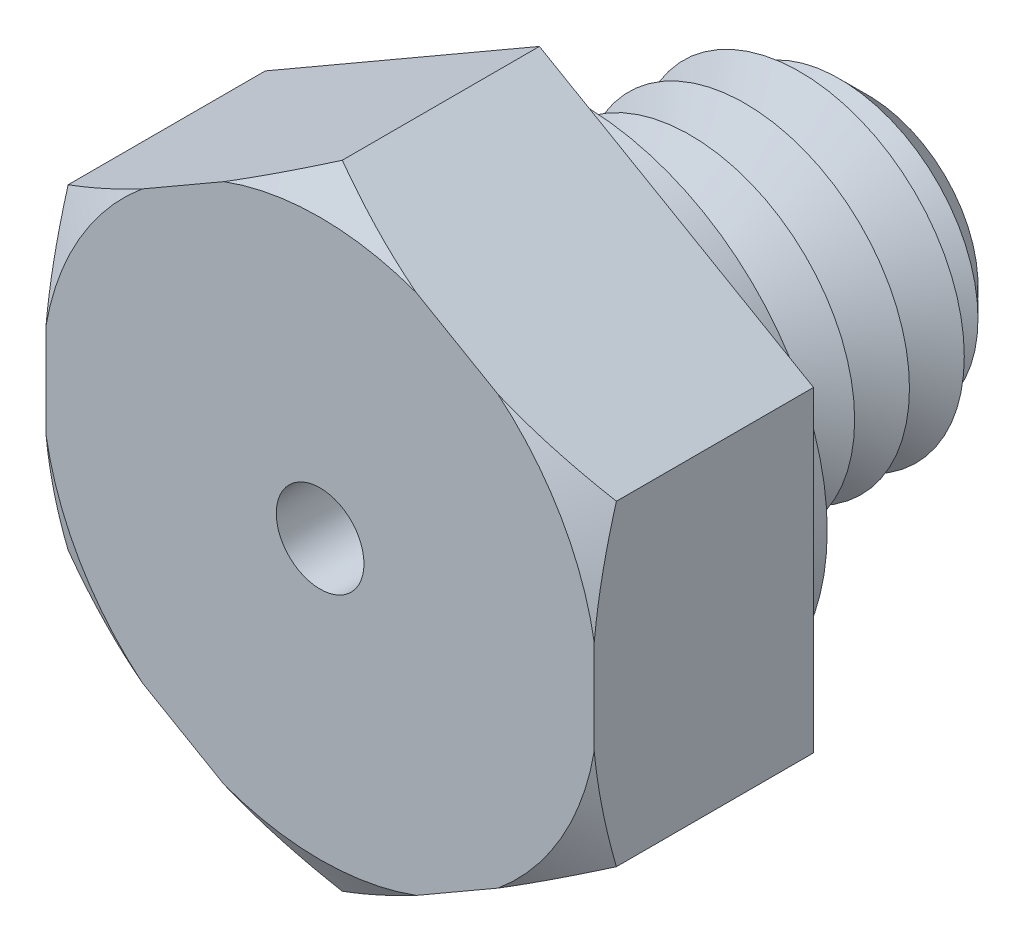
ISO-10303-21;
HEADER;
FILE_DESCRIPTION(('STEP AP214'),'2;1');
FILE_NAME('part.step','',(''),(''),'','','');
FILE_SCHEMA(('AUTOMOTIVE_DESIGN { 1 0 10303 214 1 1 1 1 }'));
ENDSEC;
DATA;
#1=APPLICATION_CONTEXT('core data for automotive mechanical design processes');
#2=APPLICATION_PROTOCOL_DEFINITION('international standard','automotive_design',2000,#1);
#3=PRODUCT_CONTEXT('',#1,'mechanical');
#4=PRODUCT('Part','Part','',(#3));
#5=PRODUCT_RELATED_PRODUCT_CATEGORY('part','',(#4));
#6=PRODUCT_DEFINITION_FORMATION('','',#4);
#7=PRODUCT_DEFINITION_CONTEXT('part definition',#1,'design');
#8=PRODUCT_DEFINITION('design','',#6,#7);
#9=PRODUCT_DEFINITION_SHAPE('','',#8);
#10=(LENGTH_UNIT() NAMED_UNIT(*) SI_UNIT(.MILLI.,.METRE.));
#11=(NAMED_UNIT(*) PLANE_ANGLE_UNIT() SI_UNIT($,.RADIAN.));
#12=(NAMED_UNIT(*) SI_UNIT($,.STERADIAN.) SOLID_ANGLE_UNIT());
#13=UNCERTAINTY_MEASURE_WITH_UNIT(LENGTH_MEASURE(1.E-05),#10,'distance_accuracy_value','');
#14=(GEOMETRIC_REPRESENTATION_CONTEXT(3) GLOBAL_UNCERTAINTY_ASSIGNED_CONTEXT((#13)) GLOBAL_UNIT_ASSIGNED_CONTEXT((#10,
#11,#12)) REPRESENTATION_CONTEXT('',''));
#15=CARTESIAN_POINT('',(0.,0.,0.));
#16=DIRECTION('',(0.,0.,1.));
#17=DIRECTION('',(1.,0.,0.));
#18=AXIS2_PLACEMENT_3D('',#15,#16,#17);
#19=CARTESIAN_POINT('',(5.,2.88675134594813,4.));
#20=DIRECTION('',(-0.5,-0.866025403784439,0.));
#21=DIRECTION('',(0.866025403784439,-0.5,0.));
#22=AXIS2_PLACEMENT_3D('',#19,#20,#21);
#23=PLANE('',#22);
#24=CARTESIAN_POINT('',(8.47277829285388,0.881741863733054,2.01100959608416));
#25=CARTESIAN_POINT('',(8.31567675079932,0.972444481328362,2.09578624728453));
#26=CARTESIAN_POINT('',(8.15819937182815,1.06336408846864,2.17964850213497));
#27=CARTESIAN_POINT('',(7.84233445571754,1.24572878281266,2.34511482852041));
#28=CARTESIAN_POINT('',(7.68394680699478,1.33717393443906,2.42671861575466));
#29=CARTESIAN_POINT('',(7.36563241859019,1.52095283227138,2.58747458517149));
#30=CARTESIAN_POINT('',(7.2057023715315,1.61328848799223,2.66661806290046));
#31=CARTESIAN_POINT('',(6.88464436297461,1.79865141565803,2.82158887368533));
#32=CARTESIAN_POINT('',(6.72351643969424,1.89167866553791,2.89741631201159));
#33=CARTESIAN_POINT('',(6.39574451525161,2.08091787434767,3.04691088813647));
#34=CARTESIAN_POINT('',(6.22906463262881,2.17715054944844,3.12047362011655));
#35=CARTESIAN_POINT('',(5.89404164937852,2.37057615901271,3.26235309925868));
#36=CARTESIAN_POINT('',(5.72569864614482,2.46776903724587,3.33067015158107));
#37=CARTESIAN_POINT('',(5.38728347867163,2.66315312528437,3.46077059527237));
#38=CARTESIAN_POINT('',(5.21721304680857,2.7613433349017,3.52255993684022));
#39=CARTESIAN_POINT('',(4.87507545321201,2.95887656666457,3.63817490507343));
#40=CARTESIAN_POINT('',(4.70300855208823,3.05821943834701,3.69200155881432));
#41=CARTESIAN_POINT('',(4.29152467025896,3.29578976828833,3.8084273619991));
#42=CARTESIAN_POINT('',(4.05114917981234,3.43457062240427,3.86669526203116));
#43=CARTESIAN_POINT('',(3.68812002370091,3.64416560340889,3.93673911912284));
#44=CARTESIAN_POINT('',(3.56670137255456,3.71426669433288,3.95719387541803));
#45=CARTESIAN_POINT('',(3.32319777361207,3.85485356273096,3.99180309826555));
#46=CARTESIAN_POINT('',(3.20111291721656,3.92533928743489,4.0059584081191));
#47=CARTESIAN_POINT('',(2.95790980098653,4.06575267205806,4.0274398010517));
#48=CARTESIAN_POINT('',(2.83679666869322,4.13567737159,4.03484289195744));
#49=CARTESIAN_POINT('',(2.59440145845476,4.27562431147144,4.04287861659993));
#50=CARTESIAN_POINT('',(2.47311938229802,4.34564655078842,4.04351132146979));
#51=CARTESIAN_POINT('',(2.23067249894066,4.48562332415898,4.03798617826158));
#52=CARTESIAN_POINT('',(2.10950769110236,4.55557785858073,4.03182836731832));
#53=CARTESIAN_POINT('',(1.86755304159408,4.69527044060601,4.01290860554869));
#54=CARTESIAN_POINT('',(1.74676325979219,4.76500845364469,4.00014564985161));
#55=CARTESIAN_POINT('',(1.46148107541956,4.92971619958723,3.96252552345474));
#56=CARTESIAN_POINT('',(1.29725580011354,5.0245317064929,3.93494657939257));
#57=CARTESIAN_POINT('',(0.970375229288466,5.21325629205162,3.86938275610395));
#58=CARTESIAN_POINT('',(0.807720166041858,5.3071652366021,3.83139636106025));
#59=CARTESIAN_POINT('',(0.484000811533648,5.49406469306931,3.7464515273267));
#60=CARTESIAN_POINT('',(0.322938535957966,5.58705404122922,3.6994829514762));
#61=CARTESIAN_POINT('',(0.0026211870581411,5.77198934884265,3.59805355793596));
#62=CARTESIAN_POINT('',(-0.156634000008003,5.86393537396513,3.54359321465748));
#63=CARTESIAN_POINT('',(-0.475335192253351,6.04793759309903,3.42778810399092));
#64=CARTESIAN_POINT('',(-0.634760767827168,6.13998199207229,3.3663688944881));
#65=CARTESIAN_POINT('',(-0.951922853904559,6.32309560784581,3.23836766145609));
#66=CARTESIAN_POINT('',(-1.10966040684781,6.41416542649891,3.17178906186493));
#67=CARTESIAN_POINT('',(-1.42369760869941,6.59547488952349,3.0343839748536));
#68=CARTESIAN_POINT('',(-1.57999755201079,6.68571470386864,2.96355838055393));
#69=CARTESIAN_POINT('',(-1.89137153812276,6.86548655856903,2.81840247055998));
#70=CARTESIAN_POINT('',(-2.0464455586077,6.95501858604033,2.74407209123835));
#71=CARTESIAN_POINT('',(-2.30843737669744,7.10627963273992,2.61560341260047));
#72=CARTESIAN_POINT('',(-2.41563149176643,7.16816818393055,2.56221329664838));
#73=CARTESIAN_POINT('',(-2.62954890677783,7.29167346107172,2.45420118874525));
#74=CARTESIAN_POINT('',(-2.7362722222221,7.35329019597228,2.39957923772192));
#75=CARTESIAN_POINT('',(-2.94817046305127,7.47562970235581,2.28983212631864));
#76=CARTESIAN_POINT('',(-3.05334983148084,7.53635503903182,2.23471838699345));
#77=CARTESIAN_POINT('',(-3.26333506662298,7.65759007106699,2.12354428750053));
#78=CARTESIAN_POINT('',(-3.36814092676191,7.71809976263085,2.06748391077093));
#79=CARTESIAN_POINT('',(-3.47277829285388,7.77851217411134,2.01100959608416));
#80=B_SPLINE_CURVE_WITH_KNOTS('',3,(#24,#25,#26,#27,#28,#29,#30,#31,#32,#33,#34,#35,#36,#37,#38,
#39,#40,#41,#42,#43,#44,#45,#46,#47,#48,#49,#50,#51,#52,#53,#54,#55,#56,#57,#58,#59,#60,#61,#62,
#63,#64,#65,#66,#67,#68,#69,#70,#71,#72,#73,#74,#75,#76,#77,#78,#79),.UNSPECIFIED.,.F.,.F.,(4,2,
2,2,2,2,2,2,2,2,2,2,2,2,2,2,2,2,2,2,2,2,2,2,2,2,2,4),(0.,0.600718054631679,1.20151138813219,
1.80423204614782,2.40693355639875,3.02500509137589,3.64304064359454,4.26050788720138,
4.87789541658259,5.72780796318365,6.1527500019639,6.57763513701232,6.99761163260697,
7.41758371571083,7.83755350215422,8.25758719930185,8.83211758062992,9.40673168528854,
9.98199815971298,10.5572282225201,11.1393271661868,11.7210430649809,12.3026370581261,
12.8842416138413,13.2886376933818,13.6930203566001,14.0931288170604,14.493244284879),.UNSPECIFIED.);
#81=CARTESIAN_POINT('',(5.,2.88675134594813,3.59585481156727));
#82=VERTEX_POINT('',#81);
#83=CARTESIAN_POINT('',(3.24519941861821,3.89988593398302,4.));
#84=VERTEX_POINT('',#83);
#85=EDGE_CURVE('E132',#82,#84,#80,.T.);
#86=ORIENTED_EDGE('',*,*,#85,.F.);
#87=DIRECTION('',(0.,0.,-1.));
#88=VECTOR('',#87,1.);
#89=CARTESIAN_POINT('',(5.,2.88675134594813,4.));
#90=LINE('',#89,#88);
#91=CARTESIAN_POINT('',(5.,2.88675134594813,0.));
#92=VERTEX_POINT('',#91);
#93=EDGE_CURVE('E144',#82,#92,#90,.T.);
#94=ORIENTED_EDGE('',*,*,#93,.T.);
#95=DIRECTION('',(-0.866025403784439,0.5,0.));
#96=VECTOR('',#95,1.);
#97=CARTESIAN_POINT('',(5.,2.88675134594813,0.));
#98=LINE('',#97,#96);
#99=CARTESIAN_POINT('',(0.,5.77350269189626,0.));
#100=VERTEX_POINT('',#99);
#101=EDGE_CURVE('E245',#92,#100,#98,.T.);
#102=ORIENTED_EDGE('',*,*,#101,.T.);
#103=DIRECTION('',(0.,0.,-1.));
#104=VECTOR('',#103,1.);
#105=CARTESIAN_POINT('',(0.,5.77350269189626,4.));
#106=LINE('',#105,#104);
#107=CARTESIAN_POINT('',(0.,5.77350269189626,3.59585481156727));
#108=VERTEX_POINT('',#107);
#109=EDGE_CURVE('E179',#108,#100,#106,.T.);
#110=ORIENTED_EDGE('',*,*,#109,.F.);
#111=CARTESIAN_POINT('',(1.75480058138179,4.76036810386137,4.));
#112=VERTEX_POINT('',#111);
#113=EDGE_CURVE('E151',#112,#108,#80,.T.);
#114=ORIENTED_EDGE('',*,*,#113,.F.);
#115=DIRECTION('',(-0.866025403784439,0.5,0.));
#116=VECTOR('',#115,1.);
#117=CARTESIAN_POINT('',(5.,2.88675134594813,4.));
#118=LINE('',#117,#116);
#119=EDGE_CURVE('E148',#84,#112,#118,.T.);
#120=ORIENTED_EDGE('',*,*,#119,.F.);
#121=EDGE_LOOP('',(#86,#94,#102,#110,#114,#120));
#122=FACE_BOUND('',#121,.T.);
#123=ADVANCED_FACE('F39',(#122),#23,.F.);
#124=CARTESIAN_POINT('',(0.,5.77350269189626,4.));
#125=DIRECTION('',(0.5,-0.866025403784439,0.));
#126=DIRECTION('',(0.866025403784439,0.5,0.));
#127=AXIS2_PLACEMENT_3D('',#124,#125,#126);
#128=PLANE('',#127);
#129=CARTESIAN_POINT('',(3.47277829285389,7.77851217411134,2.01100959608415));
#130=CARTESIAN_POINT('',(3.31567675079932,7.68780955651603,2.09578624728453));
#131=CARTESIAN_POINT('',(3.15819937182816,7.59688994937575,2.17964850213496));
#132=CARTESIAN_POINT('',(2.84233445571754,7.41452525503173,2.34511482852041));
#133=CARTESIAN_POINT('',(2.68394680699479,7.32308010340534,2.42671861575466));
#134=CARTESIAN_POINT('',(2.3656324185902,7.13930120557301,2.58747458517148));
#135=CARTESIAN_POINT('',(2.2057023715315,7.04696554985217,2.66661806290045));
#136=CARTESIAN_POINT('',(1.88464436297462,6.86160262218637,2.82158887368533));
#137=CARTESIAN_POINT('',(1.72351643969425,6.76857537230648,2.89741631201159));
#138=CARTESIAN_POINT('',(1.39574451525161,6.57933616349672,3.04691088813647));
#139=CARTESIAN_POINT('',(1.22906463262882,6.48310348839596,3.12047362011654));
#140=CARTESIAN_POINT('',(0.89404164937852,6.28967787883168,3.26235309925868));
#141=CARTESIAN_POINT('',(0.725698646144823,6.19248500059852,3.33067015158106));
#142=CARTESIAN_POINT('',(0.387283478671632,5.99710091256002,3.46077059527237));
#143=CARTESIAN_POINT('',(0.217213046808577,5.89891070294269,3.52255993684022));
#144=CARTESIAN_POINT('',(-0.124924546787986,5.70137747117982,3.63817490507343));
#145=CARTESIAN_POINT('',(-0.296991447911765,5.60203459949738,3.69200155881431));
#146=CARTESIAN_POINT('',(-0.708475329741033,5.36446426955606,3.8084273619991));
#147=CARTESIAN_POINT('',(-0.948850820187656,5.22568341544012,3.86669526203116));
#148=CARTESIAN_POINT('',(-1.31187997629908,5.0160884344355,3.93673911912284));
#149=CARTESIAN_POINT('',(-1.43329862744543,4.94598734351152,3.95719387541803));
#150=CARTESIAN_POINT('',(-1.67680222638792,4.80540047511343,3.99180309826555));
#151=CARTESIAN_POINT('',(-1.79888708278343,4.7349147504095,4.0059584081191));
#152=CARTESIAN_POINT('',(-2.04209019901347,4.59450136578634,4.0274398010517));
#153=CARTESIAN_POINT('',(-2.16320333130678,4.52457666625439,4.03484289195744));
#154=CARTESIAN_POINT('',(-2.40559854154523,4.38462972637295,4.04287861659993));
#155=CARTESIAN_POINT('',(-2.52688061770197,4.31460748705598,4.04351132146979));
#156=CARTESIAN_POINT('',(-2.76932750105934,4.17463071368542,4.03798617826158));
#157=CARTESIAN_POINT('',(-2.89049230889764,4.10467617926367,4.03182836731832));
#158=CARTESIAN_POINT('',(-3.13244695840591,3.96498359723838,4.01290860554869));
#159=CARTESIAN_POINT('',(-3.25323674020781,3.8952455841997,4.00014564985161));
#160=CARTESIAN_POINT('',(-3.53851892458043,3.73053783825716,3.96252552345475));
#161=CARTESIAN_POINT('',(-3.70274419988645,3.63572233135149,3.93494657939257));
#162=CARTESIAN_POINT('',(-4.02962477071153,3.44699774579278,3.86938275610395));
#163=CARTESIAN_POINT('',(-4.19227983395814,3.35308880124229,3.83139636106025));
#164=CARTESIAN_POINT('',(-4.51599918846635,3.16618934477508,3.7464515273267));
#165=CARTESIAN_POINT('',(-4.67706146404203,3.07319999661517,3.6994829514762));
#166=CARTESIAN_POINT('',(-4.99737881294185,2.88826468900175,3.59805355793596));
#167=CARTESIAN_POINT('',(-5.156634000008,2.79631866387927,3.54359321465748));
#168=CARTESIAN_POINT('',(-5.47533519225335,2.61231644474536,3.42778810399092));
#169=CARTESIAN_POINT('',(-5.63476076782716,2.5202720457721,3.3663688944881));
#170=CARTESIAN_POINT('',(-5.95192285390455,2.33715842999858,3.23836766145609));
#171=CARTESIAN_POINT('',(-6.10966040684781,2.24608861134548,3.17178906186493));
#172=CARTESIAN_POINT('',(-6.4236976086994,2.06477914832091,3.03438397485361));
#173=CARTESIAN_POINT('',(-6.57999755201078,1.97453933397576,2.96355838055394));
#174=CARTESIAN_POINT('',(-6.89137153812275,1.79476747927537,2.81840247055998));
#175=CARTESIAN_POINT('',(-7.04644555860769,1.70523545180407,2.74407209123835));
#176=CARTESIAN_POINT('',(-7.30843737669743,1.55397440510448,2.61560341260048));
#177=CARTESIAN_POINT('',(-7.41563149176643,1.49208585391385,2.56221329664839));
#178=CARTESIAN_POINT('',(-7.62954890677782,1.36858057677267,2.45420118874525));
#179=CARTESIAN_POINT('',(-7.7362722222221,1.30696384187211,2.39957923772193));
#180=CARTESIAN_POINT('',(-7.94817046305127,1.18462433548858,2.28983212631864));
#181=CARTESIAN_POINT('',(-8.05334983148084,1.12389899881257,2.23471838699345));
#182=CARTESIAN_POINT('',(-8.26333506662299,1.0026639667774,2.12354428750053));
#183=CARTESIAN_POINT('',(-8.36814092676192,0.942154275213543,2.06748391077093));
#184=CARTESIAN_POINT('',(-8.47277829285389,0.88174186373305,2.01100959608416));
#185=B_SPLINE_CURVE_WITH_KNOTS('',3,(#129,#130,#131,#132,#133,#134,#135,#136,#137,#138,#139,
#140,#141,#142,#143,#144,#145,#146,#147,#148,#149,#150,#151,#152,#153,#154,#155,#156,#157,#158,
#159,#160,#161,#162,#163,#164,#165,#166,#167,#168,#169,#170,#171,#172,#173,#174,#175,#176,#177,
#178,#179,#180,#181,#182,#183,#184),.UNSPECIFIED.,.F.,.F.,(4,2,2,2,2,2,2,2,2,2,2,2,2,2,2,2,2,2,
2,2,2,2,2,2,2,2,2,4),(0.,0.600718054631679,1.20151138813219,1.80423204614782,2.40693355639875,
3.02500509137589,3.64304064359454,4.26050788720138,4.87789541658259,5.72780796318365,
6.1527500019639,6.57763513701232,6.99761163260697,7.41758371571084,7.83755350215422,
8.25758719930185,8.83211758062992,9.40673168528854,9.98199815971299,10.5572282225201,
11.1393271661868,11.7210430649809,12.3026370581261,12.8842416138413,13.2886376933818,
13.6930203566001,14.0931288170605,14.493244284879),.UNSPECIFIED.);
#186=CARTESIAN_POINT('',(-1.75480058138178,4.76036810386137,4.));
#187=VERTEX_POINT('',#186);
#188=EDGE_CURVE('E296',#108,#187,#185,.T.);
#189=ORIENTED_EDGE('',*,*,#188,.F.);
#190=ORIENTED_EDGE('',*,*,#109,.T.);
#191=DIRECTION('',(-0.866025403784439,-0.5,0.));
#192=VECTOR('',#191,1.);
#193=CARTESIAN_POINT('',(0.,5.77350269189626,0.));
#194=LINE('',#193,#192);
#195=CARTESIAN_POINT('',(-5.,2.88675134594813,0.));
#196=VERTEX_POINT('',#195);
#197=EDGE_CURVE('E264',#100,#196,#194,.T.);
#198=ORIENTED_EDGE('',*,*,#197,.T.);
#199=DIRECTION('',(0.,0.,-1.));
#200=VECTOR('',#199,1.);
#201=CARTESIAN_POINT('',(-5.,2.88675134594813,4.));
#202=LINE('',#201,#200);
#203=CARTESIAN_POINT('',(-5.,2.88675134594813,3.59585481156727));
#204=VERTEX_POINT('',#203);
#205=EDGE_CURVE('E176',#204,#196,#202,.T.);
#206=ORIENTED_EDGE('',*,*,#205,.F.);
#207=CARTESIAN_POINT('',(-3.24519941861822,3.89988593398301,4.));
#208=VERTEX_POINT('',#207);
#209=EDGE_CURVE('E300',#208,#204,#185,.T.);
#210=ORIENTED_EDGE('',*,*,#209,.F.);
#211=DIRECTION('',(-0.866025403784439,-0.5,0.));
#212=VECTOR('',#211,1.);
#213=CARTESIAN_POINT('',(0.,5.77350269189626,4.));
#214=LINE('',#213,#212);
#215=EDGE_CURVE('E247',#187,#208,#214,.T.);
#216=ORIENTED_EDGE('',*,*,#215,.F.);
#217=EDGE_LOOP('',(#189,#190,#198,#206,#210,#216));
#218=FACE_BOUND('',#217,.T.);
#219=ADVANCED_FACE('F293',(#218),#128,.F.);
#220=CARTESIAN_POINT('',(-5.,2.88675134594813,4.));
#221=DIRECTION('',(1.,0.,0.));
#222=DIRECTION('',(0.,0.,-1.));
#223=AXIS2_PLACEMENT_3D('',#220,#221,#222);
#224=PLANE('',#223);
#225=CARTESIAN_POINT('',(-5.,6.35952963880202,2.25858442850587));
#226=CARTESIAN_POINT('',(-5.,6.17888675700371,2.34055079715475));
#227=CARTESIAN_POINT('',(-5.,5.99774985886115,2.42144915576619));
#228=CARTESIAN_POINT('',(-5.,5.63427640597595,2.58059164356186));
#229=CARTESIAN_POINT('',(-5.,5.45193964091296,2.65883529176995));
#230=CARTESIAN_POINT('',(-5.,5.08515575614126,2.81244019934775));
#231=CARTESIAN_POINT('',(-5.,4.90070300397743,2.8877880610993));
#232=CARTESIAN_POINT('',(-5.,4.53023851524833,3.0345384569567));
#233=CARTESIAN_POINT('',(-5.,4.34422685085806,3.10594117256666));
#234=CARTESIAN_POINT('',(-5.,3.97124978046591,3.24361472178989));
#235=CARTESIAN_POINT('',(-5.,3.78429235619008,3.30990707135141));
#236=CARTESIAN_POINT('',(-5.,3.40837814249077,3.43663614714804));
#237=CARTESIAN_POINT('',(-5.,3.21942124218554,3.49707254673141));
#238=CARTESIAN_POINT('',(-5.,2.83960832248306,3.61070280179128));
#239=CARTESIAN_POINT('',(-5.,2.64875526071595,3.66390646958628));
#240=CARTESIAN_POINT('',(-5.,2.26482213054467,3.76165698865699));
#241=CARTESIAN_POINT('',(-5.,2.07174215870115,3.80620421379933));
#242=CARTESIAN_POINT('',(-5.,1.7384332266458,3.87385543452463));
#243=CARTESIAN_POINT('',(-5.,1.59871159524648,3.89946008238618));
#244=CARTESIAN_POINT('',(-5.,1.31833206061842,3.94478995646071));
#245=CARTESIAN_POINT('',(-5.,1.17767431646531,3.96451615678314));
#246=CARTESIAN_POINT('',(-5.,0.89562976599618,3.99757345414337));
#247=CARTESIAN_POINT('',(-5.,0.754243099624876,4.01090573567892));
#248=CARTESIAN_POINT('',(-5.,0.470989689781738,4.03079351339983));
#249=CARTESIAN_POINT('',(-5.,0.329122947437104,4.03734902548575));
#250=CARTESIAN_POINT('',(-5.,0.0453101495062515,4.04347876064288));
#251=CARTESIAN_POINT('',(-5.,-0.0966358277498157,4.04305657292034));
#252=CARTESIAN_POINT('',(-5.,-0.380333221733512,4.03525341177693));
#253=CARTESIAN_POINT('',(-5.,-0.522084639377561,4.02787247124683));
#254=CARTESIAN_POINT('',(-5.,-0.805078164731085,4.00637695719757));
#255=CARTESIAN_POINT('',(-5.,-0.946320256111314,3.99226216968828));
#256=CARTESIAN_POINT('',(-5.,-1.22803871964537,3.95770663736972));
#257=CARTESIAN_POINT('',(-5.,-1.36851494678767,3.93726473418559));
#258=CARTESIAN_POINT('',(-5.,-1.92842653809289,3.84388033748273));
#259=CARTESIAN_POINT('',(-5.,-2.34409397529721,3.74768165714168));
#260=CARTESIAN_POINT('',(-5.,-2.95991397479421,3.57615402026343));
#261=CARTESIAN_POINT('',(-5.,-3.16417440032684,3.51433916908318));
#262=CARTESIAN_POINT('',(-5.,-3.57033913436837,3.3833457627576));
#263=CARTESIAN_POINT('',(-5.,-3.77224360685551,3.31416772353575));
#264=CARTESIAN_POINT('',(-5.,-4.17620397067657,3.16907432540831));
#265=CARTESIAN_POINT('',(-5.,-4.37823505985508,3.09309081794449));
#266=CARTESIAN_POINT('',(-5.,-4.7804110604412,2.9362625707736));
#267=CARTESIAN_POINT('',(-5.,-4.98055585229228,2.85541752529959));
#268=CARTESIAN_POINT('',(-5.,-5.37797431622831,2.69033488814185));
#269=CARTESIAN_POINT('',(-5.,-5.57525810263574,2.60612151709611));
#270=CARTESIAN_POINT('',(-5.,-5.96839598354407,2.43454627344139));
#271=CARTESIAN_POINT('',(-5.,-6.16425041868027,2.34718518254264));
#272=CARTESIAN_POINT('',(-5.,-6.35952963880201,2.25858442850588));
#273=B_SPLINE_CURVE_WITH_KNOTS('',3,(#225,#226,#227,#228,#229,#230,#231,#232,#233,#234,#235,
#236,#237,#238,#239,#240,#241,#242,#243,#244,#245,#246,#247,#248,#249,#250,#251,#252,#253,#254,
#255,#256,#257,#258,#259,#260,#261,#262,#263,#264,#265,#266,#267,#268,#269,#270,#271,#272),
.UNSPECIFIED.,.F.,.F.,(4,2,2,2,2,2,2,2,2,2,2,2,2,2,2,2,2,2,2,2,2,2,2,4),(0.,0.595116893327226,
1.19034103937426,1.78805021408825,2.3857318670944,2.98074146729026,3.57578423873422,
4.17001151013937,4.76421311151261,5.19024951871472,5.61621528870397,6.0421021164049,
6.46798794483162,6.89365471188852,7.3193194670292,7.74499774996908,8.17075401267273,
9.44769357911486,10.0878733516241,10.7280082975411,11.3754821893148,12.0229968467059,
12.6664852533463,13.3098149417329),.UNSPECIFIED.);
#274=CARTESIAN_POINT('',(-5.,0.860482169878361,4.));
#275=VERTEX_POINT('',#274);
#276=EDGE_CURVE('E304',#204,#275,#273,.T.);
#277=ORIENTED_EDGE('',*,*,#276,.F.);
#278=ORIENTED_EDGE('',*,*,#205,.T.);
#279=DIRECTION('',(0.,-1.,0.));
#280=VECTOR('',#279,1.);
#281=CARTESIAN_POINT('',(-5.,2.88675134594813,0.));
#282=LINE('',#281,#280);
#283=CARTESIAN_POINT('',(-5.,-2.88675134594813,0.));
#284=VERTEX_POINT('',#283);
#285=EDGE_CURVE('E267',#196,#284,#282,.T.);
#286=ORIENTED_EDGE('',*,*,#285,.T.);
#287=DIRECTION('',(0.,0.,-1.));
#288=VECTOR('',#287,1.);
#289=CARTESIAN_POINT('',(-5.,-2.88675134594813,4.));
#290=LINE('',#289,#288);
#291=CARTESIAN_POINT('',(-5.,-2.88675134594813,3.59585481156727));
#292=VERTEX_POINT('',#291);
#293=EDGE_CURVE('E173',#292,#284,#290,.T.);
#294=ORIENTED_EDGE('',*,*,#293,.F.);
#295=CARTESIAN_POINT('',(-5.,-0.860482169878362,4.));
#296=VERTEX_POINT('',#295);
#297=EDGE_CURVE('E311',#296,#292,#273,.T.);
#298=ORIENTED_EDGE('',*,*,#297,.F.);
#299=DIRECTION('',(0.,-1.,0.));
#300=VECTOR('',#299,1.);
#301=CARTESIAN_POINT('',(-5.,2.88675134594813,4.));
#302=LINE('',#301,#300);
#303=EDGE_CURVE('E251',#275,#296,#302,.T.);
#304=ORIENTED_EDGE('',*,*,#303,.F.);
#305=EDGE_LOOP('',(#277,#278,#286,#294,#298,#304));
#306=FACE_BOUND('',#305,.T.);
#307=ADVANCED_FACE('F356',(#306),#224,.F.);
#308=CARTESIAN_POINT('',(-5.,-2.88675134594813,4.));
#309=DIRECTION('',(0.5,0.866025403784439,0.));
#310=DIRECTION('',(-0.866025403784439,0.5,0.));
#311=AXIS2_PLACEMENT_3D('',#308,#309,#310);
#312=PLANE('',#311);
#313=CARTESIAN_POINT('',(-8.47277829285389,-0.881741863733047,2.01100959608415));
#314=CARTESIAN_POINT('',(-8.31567675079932,-0.972444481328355,2.09578624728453));
#315=CARTESIAN_POINT('',(-8.15819937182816,-1.06336408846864,2.17964850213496));
#316=CARTESIAN_POINT('',(-7.84233445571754,-1.24572878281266,2.34511482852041));
#317=CARTESIAN_POINT('',(-7.68394680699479,-1.33717393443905,2.42671861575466));
#318=CARTESIAN_POINT('',(-7.3656324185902,-1.52095283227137,2.58747458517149));
#319=CARTESIAN_POINT('',(-7.2057023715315,-1.61328848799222,2.66661806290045));
#320=CARTESIAN_POINT('',(-6.88464436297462,-1.79865141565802,2.82158887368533));
#321=CARTESIAN_POINT('',(-6.72351643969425,-1.89167866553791,2.89741631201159));
#322=CARTESIAN_POINT('',(-6.39574451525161,-2.08091787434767,3.04691088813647));
#323=CARTESIAN_POINT('',(-6.22906463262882,-2.17715054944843,3.12047362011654));
#324=CARTESIAN_POINT('',(-5.89404164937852,-2.3705761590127,3.26235309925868));
#325=CARTESIAN_POINT('',(-5.72569864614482,-2.46776903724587,3.33067015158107));
#326=CARTESIAN_POINT('',(-5.38728347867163,-2.66315312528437,3.46077059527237));
#327=CARTESIAN_POINT('',(-5.21721304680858,-2.7613433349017,3.52255993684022));
#328=CARTESIAN_POINT('',(-4.87507545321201,-2.95887656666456,3.63817490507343));
#329=CARTESIAN_POINT('',(-4.70300855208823,-3.058219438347,3.69200155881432));
#330=CARTESIAN_POINT('',(-4.29152467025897,-3.29578976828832,3.8084273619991));
#331=CARTESIAN_POINT('',(-4.05114917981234,-3.43457062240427,3.86669526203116));
#332=CARTESIAN_POINT('',(-3.68812002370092,-3.64416560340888,3.93673911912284));
#333=CARTESIAN_POINT('',(-3.56670137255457,-3.71426669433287,3.95719387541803));
#334=CARTESIAN_POINT('',(-3.32319777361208,-3.85485356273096,3.99180309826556));
#335=CARTESIAN_POINT('',(-3.20111291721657,-3.92533928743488,4.0059584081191));
#336=CARTESIAN_POINT('',(-2.95790980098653,-4.06575267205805,4.0274398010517));
#337=CARTESIAN_POINT('',(-2.83679666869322,-4.13567737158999,4.03484289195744));
#338=CARTESIAN_POINT('',(-2.59440145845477,-4.27562431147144,4.04287861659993));
#339=CARTESIAN_POINT('',(-2.47311938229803,-4.34564655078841,4.0435113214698));
#340=CARTESIAN_POINT('',(-2.23067249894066,-4.48562332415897,4.03798617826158));
#341=CARTESIAN_POINT('',(-2.10950769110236,-4.55557785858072,4.03182836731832));
#342=CARTESIAN_POINT('',(-1.86755304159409,-4.69527044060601,4.01290860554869));
#343=CARTESIAN_POINT('',(-1.74676325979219,-4.76500845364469,4.00014564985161));
#344=CARTESIAN_POINT('',(-1.46148107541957,-4.92971619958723,3.96252552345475));
#345=CARTESIAN_POINT('',(-1.29725580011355,-5.0245317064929,3.93494657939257));
#346=CARTESIAN_POINT('',(-0.970375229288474,-5.21325629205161,3.86938275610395));
#347=CARTESIAN_POINT('',(-0.807720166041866,-5.3071652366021,3.83139636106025));
#348=CARTESIAN_POINT('',(-0.484000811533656,-5.4940646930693,3.7464515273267));
#349=CARTESIAN_POINT('',(-0.322938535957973,-5.58705404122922,3.6994829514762));
#350=CARTESIAN_POINT('',(-0.00262118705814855,-5.77198934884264,3.59805355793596));
#351=CARTESIAN_POINT('',(0.156634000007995,-5.86393537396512,3.54359321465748));
#352=CARTESIAN_POINT('',(0.475335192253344,-6.04793759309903,3.42778810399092));
#353=CARTESIAN_POINT('',(0.634760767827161,-6.13998199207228,3.3663688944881));
#354=CARTESIAN_POINT('',(0.951922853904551,-6.32309560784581,3.23836766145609));
#355=CARTESIAN_POINT('',(1.1096604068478,-6.41416542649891,3.17178906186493));
#356=CARTESIAN_POINT('',(1.4236976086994,-6.59547488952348,3.03438397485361));
#357=CARTESIAN_POINT('',(1.57999755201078,-6.68571470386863,2.96355838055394));
#358=CARTESIAN_POINT('',(1.89137153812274,-6.86548655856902,2.81840247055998));
#359=CARTESIAN_POINT('',(2.04644555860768,-6.95501858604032,2.74407209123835));
#360=CARTESIAN_POINT('',(2.30843737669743,-7.10627963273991,2.61560341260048));
#361=CARTESIAN_POINT('',(2.41563149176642,-7.16816818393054,2.56221329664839));
#362=CARTESIAN_POINT('',(2.62954890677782,-7.29167346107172,2.45420118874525));
#363=CARTESIAN_POINT('',(2.73627222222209,-7.35329019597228,2.39957923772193));
#364=CARTESIAN_POINT('',(2.94817046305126,-7.47562970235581,2.28983212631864));
#365=CARTESIAN_POINT('',(3.05334983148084,-7.53635503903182,2.23471838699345));
#366=CARTESIAN_POINT('',(3.26333506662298,-7.65759007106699,2.12354428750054));
#367=CARTESIAN_POINT('',(3.36814092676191,-7.71809976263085,2.06748391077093));
#368=CARTESIAN_POINT('',(3.47277829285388,-7.77851217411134,2.01100959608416));
#369=B_SPLINE_CURVE_WITH_KNOTS('',3,(#313,#314,#315,#316,#317,#318,#319,#320,#321,#322,#323,
#324,#325,#326,#327,#328,#329,#330,#331,#332,#333,#334,#335,#336,#337,#338,#339,#340,#341,#342,
#343,#344,#345,#346,#347,#348,#349,#350,#351,#352,#353,#354,#355,#356,#357,#358,#359,#360,#361,
#362,#363,#364,#365,#366,#367,#368),.UNSPECIFIED.,.F.,.F.,(4,2,2,2,2,2,2,2,2,2,2,2,2,2,2,2,2,2,
2,2,2,2,2,2,2,2,2,4),(0.,0.600718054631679,1.20151138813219,1.80423204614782,2.40693355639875,
3.02500509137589,3.64304064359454,4.26050788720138,4.87789541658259,5.72780796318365,
6.1527500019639,6.57763513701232,6.99761163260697,7.41758371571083,7.83755350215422,
8.25758719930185,8.83211758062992,9.40673168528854,9.98199815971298,10.5572282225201,
11.1393271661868,11.7210430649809,12.3026370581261,12.8842416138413,13.2886376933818,
13.6930203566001,14.0931288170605,14.493244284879),.UNSPECIFIED.);
#370=CARTESIAN_POINT('',(-3.24519941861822,-3.89988593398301,4.));
#371=VERTEX_POINT('',#370);
#372=EDGE_CURVE('E352',#292,#371,#369,.T.);
#373=ORIENTED_EDGE('',*,*,#372,.F.);
#374=ORIENTED_EDGE('',*,*,#293,.T.);
#375=DIRECTION('',(0.866025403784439,-0.5,0.));
#376=VECTOR('',#375,1.);
#377=CARTESIAN_POINT('',(-5.,-2.88675134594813,0.));
#378=LINE('',#377,#376);
#379=CARTESIAN_POINT('',(0.,-5.77350269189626,0.));
#380=VERTEX_POINT('',#379);
#381=EDGE_CURVE('E271',#284,#380,#378,.T.);
#382=ORIENTED_EDGE('',*,*,#381,.T.);
#383=DIRECTION('',(0.,0.,-1.));
#384=VECTOR('',#383,1.);
#385=CARTESIAN_POINT('',(0.,-5.77350269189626,4.));
#386=LINE('',#385,#384);
#387=CARTESIAN_POINT('',(0.,-5.77350269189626,3.59585481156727));
#388=VERTEX_POINT('',#387);
#389=EDGE_CURVE('E163',#388,#380,#386,.T.);
#390=ORIENTED_EDGE('',*,*,#389,.F.);
#391=CARTESIAN_POINT('',(-1.75480058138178,-4.76036810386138,4.));
#392=VERTEX_POINT('',#391);
#393=EDGE_CURVE('E346',#392,#388,#369,.T.);
#394=ORIENTED_EDGE('',*,*,#393,.F.);
#395=DIRECTION('',(0.866025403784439,-0.5,0.));
#396=VECTOR('',#395,1.);
#397=CARTESIAN_POINT('',(-5.,-2.88675134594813,4.));
#398=LINE('',#397,#396);
#399=EDGE_CURVE('E255',#371,#392,#398,.T.);
#400=ORIENTED_EDGE('',*,*,#399,.F.);
#401=EDGE_LOOP('',(#373,#374,#382,#390,#394,#400));
#402=FACE_BOUND('',#401,.T.);
#403=ADVANCED_FACE('F353',(#402),#312,.F.);
#404=CARTESIAN_POINT('',(0.,-5.77350269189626,4.));
#405=DIRECTION('',(-0.5,0.866025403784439,0.));
#406=DIRECTION('',(-0.866025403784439,-0.5,0.));
#407=AXIS2_PLACEMENT_3D('',#404,#405,#406);
#408=PLANE('',#407);
#409=CARTESIAN_POINT('',(-3.47277829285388,-7.77851217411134,2.01100959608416));
#410=CARTESIAN_POINT('',(-3.31567675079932,-7.68780955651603,2.09578624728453));
#411=CARTESIAN_POINT('',(-3.15819937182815,-7.59688994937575,2.17964850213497));
#412=CARTESIAN_POINT('',(-2.84233445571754,-7.41452525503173,2.34511482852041));
#413=CARTESIAN_POINT('',(-2.68394680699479,-7.32308010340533,2.42671861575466));
#414=CARTESIAN_POINT('',(-2.3656324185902,-7.13930120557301,2.58747458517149));
#415=CARTESIAN_POINT('',(-2.2057023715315,-7.04696554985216,2.66661806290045));
#416=CARTESIAN_POINT('',(-1.88464436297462,-6.86160262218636,2.82158887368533));
#417=CARTESIAN_POINT('',(-1.72351643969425,-6.76857537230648,2.89741631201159));
#418=CARTESIAN_POINT('',(-1.39574451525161,-6.57933616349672,3.04691088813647));
#419=CARTESIAN_POINT('',(-1.22906463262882,-6.48310348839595,3.12047362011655));
#420=CARTESIAN_POINT('',(-0.894041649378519,-6.28967787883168,3.26235309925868));
#421=CARTESIAN_POINT('',(-0.725698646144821,-6.19248500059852,3.33067015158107));
#422=CARTESIAN_POINT('',(-0.38728347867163,-5.99710091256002,3.46077059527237));
#423=CARTESIAN_POINT('',(-0.217213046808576,-5.89891070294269,3.52255993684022));
#424=CARTESIAN_POINT('',(0.124924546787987,-5.70137747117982,3.63817490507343));
#425=CARTESIAN_POINT('',(0.296991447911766,-5.60203459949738,3.69200155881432));
#426=CARTESIAN_POINT('',(0.708475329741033,-5.36446426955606,3.8084273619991));
#427=CARTESIAN_POINT('',(0.948850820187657,-5.22568341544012,3.86669526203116));
#428=CARTESIAN_POINT('',(1.31187997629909,-5.0160884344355,3.93673911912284));
#429=CARTESIAN_POINT('',(1.43329862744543,-4.94598734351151,3.95719387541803));
#430=CARTESIAN_POINT('',(1.67680222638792,-4.80540047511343,3.99180309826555));
#431=CARTESIAN_POINT('',(1.79888708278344,-4.7349147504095,4.0059584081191));
#432=CARTESIAN_POINT('',(2.04209019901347,-4.59450136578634,4.0274398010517));
#433=CARTESIAN_POINT('',(2.16320333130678,-4.52457666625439,4.03484289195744));
#434=CARTESIAN_POINT('',(2.40559854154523,-4.38462972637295,4.04287861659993));
#435=CARTESIAN_POINT('',(2.52688061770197,-4.31460748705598,4.0435113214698));
#436=CARTESIAN_POINT('',(2.76932750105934,-4.17463071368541,4.03798617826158));
#437=CARTESIAN_POINT('',(2.89049230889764,-4.10467617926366,4.03182836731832));
#438=CARTESIAN_POINT('',(3.13244695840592,-3.96498359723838,4.01290860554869));
#439=CARTESIAN_POINT('',(3.25323674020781,-3.8952455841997,4.00014564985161));
#440=CARTESIAN_POINT('',(3.53851892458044,-3.73053783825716,3.96252552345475));
#441=CARTESIAN_POINT('',(3.70274419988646,-3.63572233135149,3.93494657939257));
#442=CARTESIAN_POINT('',(4.02962477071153,-3.44699774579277,3.86938275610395));
#443=CARTESIAN_POINT('',(4.19227983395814,-3.35308880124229,3.83139636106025));
#444=CARTESIAN_POINT('',(4.51599918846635,-3.16618934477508,3.7464515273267));
#445=CARTESIAN_POINT('',(4.67706146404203,-3.07319999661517,3.6994829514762));
#446=CARTESIAN_POINT('',(4.99737881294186,-2.88826468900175,3.59805355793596));
#447=CARTESIAN_POINT('',(5.156634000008,-2.79631866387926,3.54359321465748));
#448=CARTESIAN_POINT('',(5.47533519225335,-2.61231644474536,3.42778810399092));
#449=CARTESIAN_POINT('',(5.63476076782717,-2.5202720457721,3.3663688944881));
#450=CARTESIAN_POINT('',(5.95192285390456,-2.33715842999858,3.23836766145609));
#451=CARTESIAN_POINT('',(6.10966040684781,-2.24608861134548,3.17178906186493));
#452=CARTESIAN_POINT('',(6.4236976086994,-2.0647791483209,3.03438397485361));
#453=CARTESIAN_POINT('',(6.57999755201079,-1.97453933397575,2.96355838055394));
#454=CARTESIAN_POINT('',(6.89137153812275,-1.79476747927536,2.81840247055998));
#455=CARTESIAN_POINT('',(7.04644555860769,-1.70523545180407,2.74407209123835));
#456=CARTESIAN_POINT('',(7.30843737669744,-1.55397440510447,2.61560341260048));
#457=CARTESIAN_POINT('',(7.41563149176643,-1.49208585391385,2.56221329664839));
#458=CARTESIAN_POINT('',(7.62954890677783,-1.36858057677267,2.45420118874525));
#459=CARTESIAN_POINT('',(7.7362722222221,-1.30696384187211,2.39957923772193));
#460=CARTESIAN_POINT('',(7.94817046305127,-1.18462433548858,2.28983212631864));
#461=CARTESIAN_POINT('',(8.05334983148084,-1.12389899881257,2.23471838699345));
#462=CARTESIAN_POINT('',(8.26333506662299,-1.00266396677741,2.12354428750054));
#463=CARTESIAN_POINT('',(8.36814092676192,-0.942154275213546,2.06748391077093));
#464=CARTESIAN_POINT('',(8.47277829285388,-0.881741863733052,2.01100959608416));
#465=B_SPLINE_CURVE_WITH_KNOTS('',3,(#409,#410,#411,#412,#413,#414,#415,#416,#417,#418,#419,
#420,#421,#422,#423,#424,#425,#426,#427,#428,#429,#430,#431,#432,#433,#434,#435,#436,#437,#438,
#439,#440,#441,#442,#443,#444,#445,#446,#447,#448,#449,#450,#451,#452,#453,#454,#455,#456,#457,
#458,#459,#460,#461,#462,#463,#464),.UNSPECIFIED.,.F.,.F.,(4,2,2,2,2,2,2,2,2,2,2,2,2,2,2,2,2,2,
2,2,2,2,2,2,2,2,2,4),(0.,0.600718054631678,1.20151138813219,1.80423204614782,2.40693355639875,
3.02500509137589,3.64304064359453,4.26050788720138,4.87789541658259,5.72780796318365,
6.1527500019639,6.57763513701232,6.99761163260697,7.41758371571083,7.83755350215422,
8.25758719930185,8.83211758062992,9.40673168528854,9.98199815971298,10.5572282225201,
11.1393271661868,11.7210430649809,12.3026370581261,12.8842416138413,13.2886376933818,
13.6930203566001,14.0931288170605,14.493244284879),.UNSPECIFIED.);
#466=CARTESIAN_POINT('',(1.75480058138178,-4.76036810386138,4.));
#467=VERTEX_POINT('',#466);
#468=EDGE_CURVE('E64',#388,#467,#465,.T.);
#469=ORIENTED_EDGE('',*,*,#468,.F.);
#470=ORIENTED_EDGE('',*,*,#389,.T.);
#471=DIRECTION('',(0.866025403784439,0.5,0.));
#472=VECTOR('',#471,1.);
#473=CARTESIAN_POINT('',(0.,-5.77350269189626,0.));
#474=LINE('',#473,#472);
#475=CARTESIAN_POINT('',(5.,-2.88675134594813,0.));
#476=VERTEX_POINT('',#475);
#477=EDGE_CURVE('E274',#380,#476,#474,.T.);
#478=ORIENTED_EDGE('',*,*,#477,.T.);
#479=DIRECTION('',(0.,0.,-1.));
#480=VECTOR('',#479,1.);
#481=CARTESIAN_POINT('',(5.,-2.88675134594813,4.));
#482=LINE('',#481,#480);
#483=CARTESIAN_POINT('',(5.,-2.88675134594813,3.59585481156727));
#484=VERTEX_POINT('',#483);
#485=EDGE_CURVE('E157',#484,#476,#482,.T.);
#486=ORIENTED_EDGE('',*,*,#485,.F.);
#487=CARTESIAN_POINT('',(3.24519941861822,-3.89988593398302,4.));
#488=VERTEX_POINT('',#487);
#489=EDGE_CURVE('E341',#488,#484,#465,.T.);
#490=ORIENTED_EDGE('',*,*,#489,.F.);
#491=DIRECTION('',(0.866025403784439,0.5,0.));
#492=VECTOR('',#491,1.);
#493=CARTESIAN_POINT('',(0.,-5.77350269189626,4.));
#494=LINE('',#493,#492);
#495=EDGE_CURVE('E166',#467,#488,#494,.T.);
#496=ORIENTED_EDGE('',*,*,#495,.F.);
#497=EDGE_LOOP('',(#469,#470,#478,#486,#490,#496));
#498=FACE_BOUND('',#497,.T.);
#499=ADVANCED_FACE('F282',(#498),#408,.F.);
#500=CARTESIAN_POINT('',(5.,-2.88675134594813,4.));
#501=DIRECTION('',(-1.,0.,0.));
#502=DIRECTION('',(0.,0.,1.));
#503=AXIS2_PLACEMENT_3D('',#500,#501,#502);
#504=PLANE('',#503);
#505=CARTESIAN_POINT('',(5.,-6.35952963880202,2.25858442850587));
#506=CARTESIAN_POINT('',(5.,-6.17888675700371,2.34055079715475));
#507=CARTESIAN_POINT('',(5.,-5.99774985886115,2.42144915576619));
#508=CARTESIAN_POINT('',(5.,-5.63427640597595,2.58059164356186));
#509=CARTESIAN_POINT('',(5.,-5.45193964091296,2.65883529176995));
#510=CARTESIAN_POINT('',(5.,-5.08515575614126,2.81244019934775));
#511=CARTESIAN_POINT('',(5.,-4.90070300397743,2.8877880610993));
#512=CARTESIAN_POINT('',(5.,-4.53023851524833,3.0345384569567));
#513=CARTESIAN_POINT('',(5.,-4.34422685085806,3.10594117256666));
#514=CARTESIAN_POINT('',(5.,-3.97124978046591,3.24361472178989));
#515=CARTESIAN_POINT('',(5.,-3.78429235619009,3.30990707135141));
#516=CARTESIAN_POINT('',(5.,-3.40837814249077,3.43663614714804));
#517=CARTESIAN_POINT('',(5.,-3.21942124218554,3.49707254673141));
#518=CARTESIAN_POINT('',(5.,-2.83960832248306,3.61070280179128));
#519=CARTESIAN_POINT('',(5.,-2.64875526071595,3.66390646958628));
#520=CARTESIAN_POINT('',(5.,-2.26482213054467,3.76165698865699));
#521=CARTESIAN_POINT('',(5.,-2.07174215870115,3.80620421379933));
#522=CARTESIAN_POINT('',(5.,-1.7384332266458,3.87385543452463));
#523=CARTESIAN_POINT('',(5.,-1.59871159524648,3.89946008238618));
#524=CARTESIAN_POINT('',(5.,-1.31833206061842,3.94478995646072));
#525=CARTESIAN_POINT('',(5.,-1.17767431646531,3.96451615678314));
#526=CARTESIAN_POINT('',(5.,-0.895629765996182,3.99757345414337));
#527=CARTESIAN_POINT('',(5.,-0.754243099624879,4.01090573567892));
#528=CARTESIAN_POINT('',(5.,-0.47098968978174,4.03079351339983));
#529=CARTESIAN_POINT('',(5.,-0.329122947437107,4.03734902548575));
#530=CARTESIAN_POINT('',(5.,-0.0453101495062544,4.04347876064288));
#531=CARTESIAN_POINT('',(5.,0.0966358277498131,4.04305657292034));
#532=CARTESIAN_POINT('',(5.,0.38033322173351,4.03525341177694));
#533=CARTESIAN_POINT('',(5.,0.522084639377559,4.02787247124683));
#534=CARTESIAN_POINT('',(5.,0.805078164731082,4.00637695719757));
#535=CARTESIAN_POINT('',(5.,0.946320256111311,3.99226216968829));
#536=CARTESIAN_POINT('',(5.,1.22803871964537,3.95770663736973));
#537=CARTESIAN_POINT('',(5.,1.36851494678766,3.93726473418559));
#538=CARTESIAN_POINT('',(5.,1.92842653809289,3.84388033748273));
#539=CARTESIAN_POINT('',(5.,2.34409397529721,3.74768165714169));
#540=CARTESIAN_POINT('',(5.,2.95991397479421,3.57615402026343));
#541=CARTESIAN_POINT('',(5.,3.16417440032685,3.51433916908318));
#542=CARTESIAN_POINT('',(5.,3.57033913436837,3.3833457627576));
#543=CARTESIAN_POINT('',(5.,3.77224360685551,3.31416772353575));
#544=CARTESIAN_POINT('',(5.,4.17620397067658,3.16907432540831));
#545=CARTESIAN_POINT('',(5.,4.37823505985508,3.09309081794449));
#546=CARTESIAN_POINT('',(5.,4.78041106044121,2.9362625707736));
#547=CARTESIAN_POINT('',(5.,4.98055585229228,2.85541752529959));
#548=CARTESIAN_POINT('',(5.,5.37797431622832,2.69033488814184));
#549=CARTESIAN_POINT('',(5.,5.57525810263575,2.60612151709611));
#550=CARTESIAN_POINT('',(5.,5.96839598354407,2.43454627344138));
#551=CARTESIAN_POINT('',(5.,6.16425041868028,2.34718518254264));
#552=CARTESIAN_POINT('',(5.,6.35952963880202,2.25858442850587));
#553=B_SPLINE_CURVE_WITH_KNOTS('',3,(#505,#506,#507,#508,#509,#510,#511,#512,#513,#514,#515,
#516,#517,#518,#519,#520,#521,#522,#523,#524,#525,#526,#527,#528,#529,#530,#531,#532,#533,#534,
#535,#536,#537,#538,#539,#540,#541,#542,#543,#544,#545,#546,#547,#548,#549,#550,#551,#552),
.UNSPECIFIED.,.F.,.F.,(4,2,2,2,2,2,2,2,2,2,2,2,2,2,2,2,2,2,2,2,2,2,2,4),(0.,0.595116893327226,
1.19034103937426,1.78805021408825,2.3857318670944,2.98074146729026,3.57578423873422,
4.17001151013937,4.76421311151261,5.19024951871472,5.61621528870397,6.0421021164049,
6.46798794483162,6.89365471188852,7.3193194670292,7.74499774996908,8.17075401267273,
9.44769357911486,10.0878733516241,10.7280082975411,11.3754821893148,12.0229968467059,
12.6664852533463,13.3098149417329),.UNSPECIFIED.);
#554=CARTESIAN_POINT('',(5.,-0.860482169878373,4.));
#555=VERTEX_POINT('',#554);
#556=EDGE_CURVE('E56',#484,#555,#553,.T.);
#557=ORIENTED_EDGE('',*,*,#556,.F.);
#558=ORIENTED_EDGE('',*,*,#485,.T.);
#559=DIRECTION('',(0.,1.,0.));
#560=VECTOR('',#559,1.);
#561=CARTESIAN_POINT('',(5.,-2.88675134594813,0.));
#562=LINE('',#561,#560);
#563=EDGE_CURVE('E154',#476,#92,#562,.T.);
#564=ORIENTED_EDGE('',*,*,#563,.T.);
#565=ORIENTED_EDGE('',*,*,#93,.F.);
#566=CARTESIAN_POINT('',(5.,0.860482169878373,4.));
#567=VERTEX_POINT('',#566);
#568=EDGE_CURVE('E129',#567,#82,#553,.T.);
#569=ORIENTED_EDGE('',*,*,#568,.F.);
#570=DIRECTION('',(0.,1.,0.));
#571=VECTOR('',#570,1.);
#572=CARTESIAN_POINT('',(5.,-2.88675134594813,4.));
#573=LINE('',#572,#571);
#574=EDGE_CURVE('E158',#555,#567,#573,.T.);
#575=ORIENTED_EDGE('',*,*,#574,.F.);
#576=EDGE_LOOP('',(#557,#558,#564,#565,#569,#575));
#577=FACE_BOUND('',#576,.T.);
#578=ADVANCED_FACE('F152',(#577),#504,.F.);
#579=CARTESIAN_POINT('',(0.,0.,4.));
#580=DIRECTION('',(0.,0.,1.));
#581=DIRECTION('',(1.,0.,0.));
#582=AXIS2_PLACEMENT_3D('',#579,#580,#581);
#583=PLANE('',#582);
#584=CARTESIAN_POINT('',(0.,0.,4.));
#585=DIRECTION('',(0.,0.,1.));
#586=DIRECTION('',(1.,0.,0.));
#587=AXIS2_PLACEMENT_3D('',#584,#585,#586);
#588=CIRCLE('',#587,0.8);
#589=CARTESIAN_POINT('',(0.8,0.,4.));
#590=VERTEX_POINT('',#589);
#591=EDGE_CURVE('E643',#590,#590,#588,.T.);
#592=ORIENTED_EDGE('',*,*,#591,.F.);
#593=EDGE_LOOP('',(#592));
#594=FACE_BOUND('',#593,.T.);
#595=ORIENTED_EDGE('',*,*,#574,.T.);
#596=CARTESIAN_POINT('',(0.,0.,4.));
#597=DIRECTION('',(0.,0.,1.));
#598=DIRECTION('',(1.,0.,0.));
#599=AXIS2_PLACEMENT_3D('',#596,#597,#598);
#600=CIRCLE('',#599,5.07350269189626);
#601=EDGE_CURVE('E134',#567,#84,#600,.T.);
#602=ORIENTED_EDGE('',*,*,#601,.T.);
#603=ORIENTED_EDGE('',*,*,#119,.T.);
#604=CARTESIAN_POINT('',(0.,0.,4.));
#605=DIRECTION('',(0.,0.,1.));
#606=DIRECTION('',(1.,0.,0.));
#607=AXIS2_PLACEMENT_3D('',#604,#605,#606);
#608=CIRCLE('',#607,5.07350269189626);
#609=EDGE_CURVE('E11',#112,#187,#608,.T.);
#610=ORIENTED_EDGE('',*,*,#609,.T.);
#611=ORIENTED_EDGE('',*,*,#215,.T.);
#612=EDGE_CURVE('E49',#208,#275,#608,.T.);
#613=ORIENTED_EDGE('',*,*,#612,.T.);
#614=ORIENTED_EDGE('',*,*,#303,.T.);
#615=EDGE_CURVE('E656',#296,#371,#608,.T.);
#616=ORIENTED_EDGE('',*,*,#615,.T.);
#617=ORIENTED_EDGE('',*,*,#399,.T.);
#618=EDGE_CURVE('E658',#392,#467,#608,.T.);
#619=ORIENTED_EDGE('',*,*,#618,.T.);
#620=ORIENTED_EDGE('',*,*,#495,.T.);
#621=EDGE_CURVE('E43',#488,#555,#608,.T.);
#622=ORIENTED_EDGE('',*,*,#621,.T.);
#623=EDGE_LOOP('',(#595,#602,#603,#610,#611,#613,#614,#616,#617,#619,#620,#622));
#624=FACE_BOUND('',#623,.T.);
#625=ADVANCED_FACE('F394',(#594,#624),#583,.T.);
#626=CARTESIAN_POINT('',(0.,0.,0.));
#627=DIRECTION('',(0.,0.,1.));
#628=DIRECTION('',(1.,0.,0.));
#629=AXIS2_PLACEMENT_3D('',#626,#627,#628);
#630=PLANE('',#629);
#631=CARTESIAN_POINT('',(0.,0.,0.));
#632=DIRECTION('',(0.,0.,1.));
#633=DIRECTION('',(1.,0.,0.));
#634=AXIS2_PLACEMENT_3D('',#631,#632,#633);
#635=CIRCLE('',#634,4.5);
#636=CARTESIAN_POINT('',(4.5,0.,0.));
#637=VERTEX_POINT('',#636);
#638=EDGE_CURVE('E182',#637,#637,#635,.F.);
#639=ORIENTED_EDGE('',*,*,#638,.F.);
#640=EDGE_LOOP('',(#639));
#641=FACE_BOUND('',#640,.T.);
#642=ORIENTED_EDGE('',*,*,#101,.F.);
#643=ORIENTED_EDGE('',*,*,#563,.F.);
#644=ORIENTED_EDGE('',*,*,#477,.F.);
#645=ORIENTED_EDGE('',*,*,#381,.F.);
#646=ORIENTED_EDGE('',*,*,#285,.F.);
#647=ORIENTED_EDGE('',*,*,#197,.F.);
#648=EDGE_LOOP('',(#642,#643,#644,#645,#646,#647));
#649=FACE_BOUND('',#648,.T.);
#650=ADVANCED_FACE('F287',(#641,#649),#630,.F.);
#651=CARTESIAN_POINT('',(0.,0.,-0.75));
#652=DIRECTION('',(0.,0.,1.));
#653=DIRECTION('',(1.,0.,0.));
#654=AXIS2_PLACEMENT_3D('',#651,#652,#653);
#655=CYLINDRICAL_SURFACE('',#654,4.5);
#656=CARTESIAN_POINT('',(0.,0.,-0.75));
#657=DIRECTION('',(0.,0.,-1.));
#658=DIRECTION('',(-1.,0.,0.));
#659=AXIS2_PLACEMENT_3D('',#656,#657,#658);
#660=CIRCLE('',#659,4.5);
#661=CARTESIAN_POINT('',(-4.5,0.,-0.75));
#662=VERTEX_POINT('',#661);
#663=EDGE_CURVE('E241',#662,#662,#660,.T.);
#664=ORIENTED_EDGE('',*,*,#663,.F.);
#665=EDGE_LOOP('',(#664));
#666=FACE_BOUND('',#665,.T.);
#667=ORIENTED_EDGE('',*,*,#638,.T.);
#668=EDGE_LOOP('',(#667));
#669=FACE_BOUND('',#668,.T.);
#670=ADVANCED_FACE('F412',(#666,#669),#655,.T.);
#671=CARTESIAN_POINT('',(0.,0.,-0.75));
#672=DIRECTION('',(0.,0.,-1.));
#673=DIRECTION('',(-1.,0.,0.));
#674=AXIS2_PLACEMENT_3D('',#671,#672,#673);
#675=PLANE('',#674);
#676=CARTESIAN_POINT('',(0.,0.,-0.75));
#677=DIRECTION('',(0.,0.,1.));
#678=DIRECTION('',(1.,0.,0.));
#679=AXIS2_PLACEMENT_3D('',#676,#677,#678);
#680=CIRCLE('',#679,3.);
#681=CARTESIAN_POINT('',(3.,0.,-0.75));
#682=VERTEX_POINT('',#681);
#683=EDGE_CURVE('E237',#682,#682,#680,.T.);
#684=ORIENTED_EDGE('',*,*,#683,.T.);
#685=EDGE_LOOP('',(#684));
#686=FACE_BOUND('',#685,.T.);
#687=ORIENTED_EDGE('',*,*,#663,.T.);
#688=EDGE_LOOP('',(#687));
#689=FACE_BOUND('',#688,.T.);
#690=ADVANCED_FACE('F421',(#686,#689),#675,.T.);
#691=CARTESIAN_POINT('',(0.,0.,-0.75));
#692=DIRECTION('',(0.,0.,1.));
#693=DIRECTION('',(1.,0.,0.));
#694=AXIS2_PLACEMENT_3D('',#691,#692,#693);
#695=CONICAL_SURFACE('',#694,3.,1.0471975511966);
#696=CARTESIAN_POINT('',(0.,0.,-1.25));
#697=DIRECTION('',(0.,0.,1.));
#698=DIRECTION('',(1.,0.,0.));
#699=AXIS2_PLACEMENT_3D('',#696,#697,#698);
#700=CIRCLE('',#699,2.13397459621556);
#701=CARTESIAN_POINT('',(2.13397459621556,0.,-1.25));
#702=VERTEX_POINT('',#701);
#703=EDGE_CURVE('E233',#702,#702,#700,.T.);
#704=ORIENTED_EDGE('',*,*,#703,.T.);
#705=EDGE_LOOP('',(#704));
#706=FACE_BOUND('',#705,.T.);
#707=ORIENTED_EDGE('',*,*,#683,.F.);
#708=EDGE_LOOP('',(#707));
#709=FACE_BOUND('',#708,.T.);
#710=ADVANCED_FACE('F430',(#706,#709),#695,.T.);
#711=CARTESIAN_POINT('',(0.,0.,-1.25));
#712=DIRECTION('',(0.,0.,-1.));
#713=DIRECTION('',(-1.,0.,0.));
#714=AXIS2_PLACEMENT_3D('',#711,#712,#713);
#715=CONICAL_SURFACE('',#714,2.13397459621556,1.0471975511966);
#716=CARTESIAN_POINT('',(0.,0.,-1.75));
#717=DIRECTION('',(0.,0.,1.));
#718=DIRECTION('',(1.,0.,0.));
#719=AXIS2_PLACEMENT_3D('',#716,#717,#718);
#720=CIRCLE('',#719,3.);
#721=CARTESIAN_POINT('',(3.,0.,-1.75));
#722=VERTEX_POINT('',#721);
#723=EDGE_CURVE('E229',#722,#722,#720,.T.);
#724=ORIENTED_EDGE('',*,*,#723,.T.);
#725=EDGE_LOOP('',(#724));
#726=FACE_BOUND('',#725,.T.);
#727=ORIENTED_EDGE('',*,*,#703,.F.);
#728=EDGE_LOOP('',(#727));
#729=FACE_BOUND('',#728,.T.);
#730=ADVANCED_FACE('F439',(#726,#729),#715,.T.);
#731=CARTESIAN_POINT('',(0.,0.,-1.75));
#732=DIRECTION('',(0.,0.,1.));
#733=DIRECTION('',(1.,0.,0.));
#734=AXIS2_PLACEMENT_3D('',#731,#732,#733);
#735=CONICAL_SURFACE('',#734,3.,1.0471975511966);
#736=CARTESIAN_POINT('',(0.,0.,-2.25));
#737=DIRECTION('',(0.,0.,1.));
#738=DIRECTION('',(1.,0.,0.));
#739=AXIS2_PLACEMENT_3D('',#736,#737,#738);
#740=CIRCLE('',#739,2.13397459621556);
#741=CARTESIAN_POINT('',(2.13397459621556,0.,-2.25));
#742=VERTEX_POINT('',#741);
#743=EDGE_CURVE('E225',#742,#742,#740,.T.);
#744=ORIENTED_EDGE('',*,*,#743,.T.);
#745=EDGE_LOOP('',(#744));
#746=FACE_BOUND('',#745,.T.);
#747=ORIENTED_EDGE('',*,*,#723,.F.);
#748=EDGE_LOOP('',(#747));
#749=FACE_BOUND('',#748,.T.);
#750=ADVANCED_FACE('F448',(#746,#749),#735,.T.);
#751=CARTESIAN_POINT('',(0.,0.,-2.25));
#752=DIRECTION('',(0.,0.,-1.));
#753=DIRECTION('',(-1.,0.,0.));
#754=AXIS2_PLACEMENT_3D('',#751,#752,#753);
#755=CONICAL_SURFACE('',#754,2.13397459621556,1.0471975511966);
#756=CARTESIAN_POINT('',(0.,0.,-2.75));
#757=DIRECTION('',(0.,0.,1.));
#758=DIRECTION('',(1.,0.,0.));
#759=AXIS2_PLACEMENT_3D('',#756,#757,#758);
#760=CIRCLE('',#759,3.);
#761=CARTESIAN_POINT('',(3.,0.,-2.75));
#762=VERTEX_POINT('',#761);
#763=EDGE_CURVE('E221',#762,#762,#760,.T.);
#764=ORIENTED_EDGE('',*,*,#763,.T.);
#765=EDGE_LOOP('',(#764));
#766=FACE_BOUND('',#765,.T.);
#767=ORIENTED_EDGE('',*,*,#743,.F.);
#768=EDGE_LOOP('',(#767));
#769=FACE_BOUND('',#768,.T.);
#770=ADVANCED_FACE('F457',(#766,#769),#755,.T.);
#771=CARTESIAN_POINT('',(0.,0.,-2.75));
#772=DIRECTION('',(0.,0.,1.));
#773=DIRECTION('',(1.,0.,0.));
#774=AXIS2_PLACEMENT_3D('',#771,#772,#773);
#775=CONICAL_SURFACE('',#774,3.,1.0471975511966);
#776=CARTESIAN_POINT('',(0.,0.,-3.25));
#777=DIRECTION('',(0.,0.,1.));
#778=DIRECTION('',(1.,0.,0.));
#779=AXIS2_PLACEMENT_3D('',#776,#777,#778);
#780=CIRCLE('',#779,2.13397459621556);
#781=CARTESIAN_POINT('',(2.13397459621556,0.,-3.25));
#782=VERTEX_POINT('',#781);
#783=EDGE_CURVE('E217',#782,#782,#780,.T.);
#784=ORIENTED_EDGE('',*,*,#783,.T.);
#785=EDGE_LOOP('',(#784));
#786=FACE_BOUND('',#785,.T.);
#787=ORIENTED_EDGE('',*,*,#763,.F.);
#788=EDGE_LOOP('',(#787));
#789=FACE_BOUND('',#788,.T.);
#790=ADVANCED_FACE('F466',(#786,#789),#775,.T.);
#791=CARTESIAN_POINT('',(0.,0.,-3.25));
#792=DIRECTION('',(0.,0.,-1.));
#793=DIRECTION('',(-1.,0.,0.));
#794=AXIS2_PLACEMENT_3D('',#791,#792,#793);
#795=CONICAL_SURFACE('',#794,2.13397459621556,1.0471975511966);
#796=CARTESIAN_POINT('',(0.,0.,-3.75));
#797=DIRECTION('',(0.,0.,1.));
#798=DIRECTION('',(1.,0.,0.));
#799=AXIS2_PLACEMENT_3D('',#796,#797,#798);
#800=CIRCLE('',#799,3.);
#801=CARTESIAN_POINT('',(3.,0.,-3.75));
#802=VERTEX_POINT('',#801);
#803=EDGE_CURVE('E200',#802,#802,#800,.T.);
#804=ORIENTED_EDGE('',*,*,#803,.T.);
#805=EDGE_LOOP('',(#804));
#806=FACE_BOUND('',#805,.T.);
#807=ORIENTED_EDGE('',*,*,#783,.F.);
#808=EDGE_LOOP('',(#807));
#809=FACE_BOUND('',#808,.T.);
#810=ADVANCED_FACE('F475',(#806,#809),#795,.T.);
#811=CARTESIAN_POINT('',(0.,0.,-3.75));
#812=DIRECTION('',(0.,0.,1.));
#813=DIRECTION('',(1.,0.,0.));
#814=AXIS2_PLACEMENT_3D('',#811,#812,#813);
#815=CONICAL_SURFACE('',#814,3.,1.0471975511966);
#816=CARTESIAN_POINT('',(0.,0.,-4.25));
#817=DIRECTION('',(0.,0.,1.));
#818=DIRECTION('',(1.,0.,0.));
#819=AXIS2_PLACEMENT_3D('',#816,#817,#818);
#820=CIRCLE('',#819,2.13397459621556);
#821=CARTESIAN_POINT('',(2.13397459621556,0.,-4.25));
#822=VERTEX_POINT('',#821);
#823=EDGE_CURVE('E192',#822,#822,#820,.T.);
#824=ORIENTED_EDGE('',*,*,#823,.T.);
#825=EDGE_LOOP('',(#824));
#826=FACE_BOUND('',#825,.T.);
#827=ORIENTED_EDGE('',*,*,#803,.F.);
#828=EDGE_LOOP('',(#827));
#829=FACE_BOUND('',#828,.T.);
#830=ADVANCED_FACE('F484',(#826,#829),#815,.T.);
#831=CARTESIAN_POINT('',(0.,0.,-4.25));
#832=DIRECTION('',(0.,0.,-1.));
#833=DIRECTION('',(-1.,0.,0.));
#834=AXIS2_PLACEMENT_3D('',#831,#832,#833);
#835=CONICAL_SURFACE('',#834,2.13397459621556,1.0471975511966);
#836=CARTESIAN_POINT('',(0.,0.,-4.75));
#837=DIRECTION('',(0.,0.,1.));
#838=DIRECTION('',(1.,0.,0.));
#839=AXIS2_PLACEMENT_3D('',#836,#837,#838);
#840=CIRCLE('',#839,3.);
#841=CARTESIAN_POINT('',(3.,0.,-4.75));
#842=VERTEX_POINT('',#841);
#843=EDGE_CURVE('E193',#842,#842,#840,.T.);
#844=ORIENTED_EDGE('',*,*,#843,.T.);
#845=EDGE_LOOP('',(#844));
#846=FACE_BOUND('',#845,.T.);
#847=ORIENTED_EDGE('',*,*,#823,.F.);
#848=EDGE_LOOP('',(#847));
#849=FACE_BOUND('',#848,.T.);
#850=ADVANCED_FACE('F493',(#846,#849),#835,.T.);
#851=CARTESIAN_POINT('',(0.,0.,-4.75));
#852=DIRECTION('',(0.,0.,1.));
#853=DIRECTION('',(1.,0.,0.));
#854=AXIS2_PLACEMENT_3D('',#851,#852,#853);
#855=CONICAL_SURFACE('',#854,3.,1.0471975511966);
#856=CARTESIAN_POINT('',(0.,0.,-5.25));
#857=DIRECTION('',(0.,0.,1.));
#858=DIRECTION('',(1.,0.,0.));
#859=AXIS2_PLACEMENT_3D('',#856,#857,#858);
#860=CIRCLE('',#859,2.13397459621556);
#861=CARTESIAN_POINT('',(2.13397459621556,0.,-5.25));
#862=VERTEX_POINT('',#861);
#863=EDGE_CURVE('E204',#862,#862,#860,.T.);
#864=ORIENTED_EDGE('',*,*,#863,.T.);
#865=EDGE_LOOP('',(#864));
#866=FACE_BOUND('',#865,.T.);
#867=ORIENTED_EDGE('',*,*,#843,.F.);
#868=EDGE_LOOP('',(#867));
#869=FACE_BOUND('',#868,.T.);
#870=ADVANCED_FACE('F502',(#866,#869),#855,.T.);
#871=CARTESIAN_POINT('',(0.,0.,-5.25));
#872=DIRECTION('',(0.,0.,-1.));
#873=DIRECTION('',(-1.,0.,0.));
#874=AXIS2_PLACEMENT_3D('',#871,#872,#873);
#875=CONICAL_SURFACE('',#874,2.13397459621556,1.0471975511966);
#876=CARTESIAN_POINT('',(0.,0.,-5.47548094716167));
#877=DIRECTION('',(0.,0.,-1.));
#878=DIRECTION('',(-1.,0.,0.));
#879=AXIS2_PLACEMENT_3D('',#876,#877,#878);
#880=CIRCLE('',#879,2.52451905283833);
#881=CARTESIAN_POINT('',(-2.52451905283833,0.,-5.47548094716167));
#882=VERTEX_POINT('',#881);
#883=EDGE_CURVE('E189',#882,#882,#880,.T.);
#884=ORIENTED_EDGE('',*,*,#883,.F.);
#885=EDGE_LOOP('',(#884));
#886=FACE_BOUND('',#885,.T.);
#887=ORIENTED_EDGE('',*,*,#863,.F.);
#888=EDGE_LOOP('',(#887));
#889=FACE_BOUND('',#888,.T.);
#890=ADVANCED_FACE('F325',(#886,#889),#875,.T.);
#891=CARTESIAN_POINT('',(0.,0.,-6.));
#892=DIRECTION('',(0.,0.,-1.));
#893=DIRECTION('',(-1.,0.,0.));
#894=AXIS2_PLACEMENT_3D('',#891,#892,#893);
#895=PLANE('',#894);
#896=CARTESIAN_POINT('',(0.,0.,-6.));
#897=DIRECTION('',(0.,0.,-1.));
#898=DIRECTION('',(-1.,0.,0.));
#899=AXIS2_PLACEMENT_3D('',#896,#897,#898);
#900=CIRCLE('',#899,0.8);
#901=CARTESIAN_POINT('',(-0.8,0.,-6.));
#902=VERTEX_POINT('',#901);
#903=EDGE_CURVE('E646',#902,#902,#900,.F.);
#904=ORIENTED_EDGE('',*,*,#903,.T.);
#905=EDGE_LOOP('',(#904));
#906=FACE_BOUND('',#905,.T.);
#907=CARTESIAN_POINT('',(0.,0.,-6.));
#908=DIRECTION('',(0.,0.,-1.));
#909=DIRECTION('',(-1.,0.,0.));
#910=AXIS2_PLACEMENT_3D('',#907,#908,#909);
#911=CIRCLE('',#910,2.);
#912=CARTESIAN_POINT('',(-2.,0.,-6.));
#913=VERTEX_POINT('',#912);
#914=EDGE_CURVE('E186',#913,#913,#911,.T.);
#915=ORIENTED_EDGE('',*,*,#914,.T.);
#916=EDGE_LOOP('',(#915));
#917=FACE_BOUND('',#916,.T.);
#918=ADVANCED_FACE('F517',(#906,#917),#895,.T.);
#919=CARTESIAN_POINT('',(0.,0.,-6.));
#920=DIRECTION('',(0.,0.,1.));
#921=DIRECTION('',(1.,0.,0.));
#922=AXIS2_PLACEMENT_3D('',#919,#920,#921);
#923=CONICAL_SURFACE('',#922,2.,0.785398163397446);
#924=ORIENTED_EDGE('',*,*,#914,.F.);
#925=EDGE_LOOP('',(#924));
#926=FACE_BOUND('',#925,.T.);
#927=ORIENTED_EDGE('',*,*,#883,.T.);
#928=EDGE_LOOP('',(#927));
#929=FACE_BOUND('',#928,.T.);
#930=ADVANCED_FACE('F41',(#926,#929),#923,.T.);
#931=CARTESIAN_POINT('',(0.,0.,4.));
#932=DIRECTION('',(0.,0.,-1.));
#933=DIRECTION('',(-1.,0.,0.));
#934=AXIS2_PLACEMENT_3D('',#931,#932,#933);
#935=CONICAL_SURFACE('',#934,5.07350269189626,1.0471975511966);
#936=ORIENTED_EDGE('',*,*,#489,.T.);
#937=ORIENTED_EDGE('',*,*,#556,.T.);
#938=ORIENTED_EDGE('',*,*,#621,.F.);
#939=EDGE_LOOP('',(#936,#937,#938));
#940=FACE_BOUND('',#939,.T.);
#941=ADVANCED_FACE('F533',(#940),#935,.T.);
#942=ORIENTED_EDGE('',*,*,#393,.T.);
#943=ORIENTED_EDGE('',*,*,#468,.T.);
#944=ORIENTED_EDGE('',*,*,#618,.F.);
#945=EDGE_LOOP('',(#942,#943,#944));
#946=FACE_BOUND('',#945,.T.);
#947=ADVANCED_FACE('F540',(#946),#935,.T.);
#948=ORIENTED_EDGE('',*,*,#297,.T.);
#949=ORIENTED_EDGE('',*,*,#372,.T.);
#950=ORIENTED_EDGE('',*,*,#615,.F.);
#951=EDGE_LOOP('',(#948,#949,#950));
#952=FACE_BOUND('',#951,.T.);
#953=ADVANCED_FACE('F547',(#952),#935,.T.);
#954=ORIENTED_EDGE('',*,*,#209,.T.);
#955=ORIENTED_EDGE('',*,*,#276,.T.);
#956=ORIENTED_EDGE('',*,*,#612,.F.);
#957=EDGE_LOOP('',(#954,#955,#956));
#958=FACE_BOUND('',#957,.T.);
#959=ADVANCED_FACE('F323',(#958),#935,.T.);
#960=ORIENTED_EDGE('',*,*,#113,.T.);
#961=ORIENTED_EDGE('',*,*,#188,.T.);
#962=ORIENTED_EDGE('',*,*,#609,.F.);
#963=EDGE_LOOP('',(#960,#961,#962));
#964=FACE_BOUND('',#963,.T.);
#965=ADVANCED_FACE('F318',(#964),#935,.T.);
#966=ORIENTED_EDGE('',*,*,#85,.T.);
#967=ORIENTED_EDGE('',*,*,#601,.F.);
#968=ORIENTED_EDGE('',*,*,#568,.T.);
#969=EDGE_LOOP('',(#966,#967,#968));
#970=FACE_BOUND('',#969,.T.);
#971=ADVANCED_FACE('F131',(#970),#935,.T.);
#972=CARTESIAN_POINT('',(0.,0.,-8.26274169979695));
#973=DIRECTION('',(0.,0.,1.));
#974=DIRECTION('',(1.,0.,0.));
#975=AXIS2_PLACEMENT_3D('',#972,#973,#974);
#976=CYLINDRICAL_SURFACE('',#975,0.8);
#977=ORIENTED_EDGE('',*,*,#591,.T.);
#978=EDGE_LOOP('',(#977));
#979=FACE_BOUND('',#978,.T.);
#980=ORIENTED_EDGE('',*,*,#903,.F.);
#981=EDGE_LOOP('',(#980));
#982=FACE_BOUND('',#981,.T.);
#983=ADVANCED_FACE('F324',(#979,#982),#976,.F.);
#984=CLOSED_SHELL('',(#123,#219,#307,#403,#499,#578,#625,#650,#670,#690,#710,#730,#750,#770,
#790,#810,#830,#850,#870,#890,#918,#930,#941,#947,#953,#959,#965,#971,#983));
#985=MANIFOLD_SOLID_BREP('B2',#984);
#986=ADVANCED_BREP_SHAPE_REPRESENTATION('',(#18,#985),#14);
#987=SHAPE_DEFINITION_REPRESENTATION(#9,#986);
ENDSEC;
END-ISO-10303-21;
